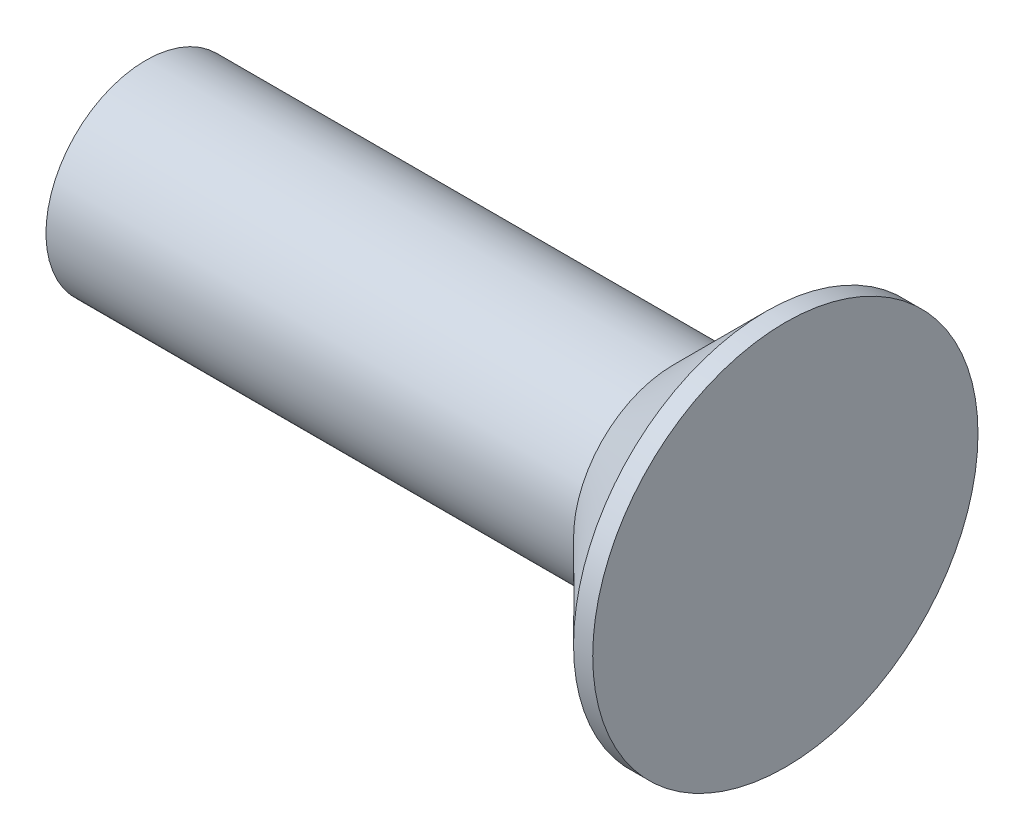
from build123d import *


with BuildPart() as part:
    # Croquis1 → Revoluci_n1 (revolve)
    with BuildSketch(Plane.XY.offset(-252.5)):
        Polygon((-9.9, -3), (-9.9, -5.5), (6.1, -5.5), (6.1, -0.68), (5.62, -0.68), (3.3, -3), align=None)
    revolve(axis=Axis((-9.9, -5.5, -252.5), (1, 0, 0)))


solid = part.part
